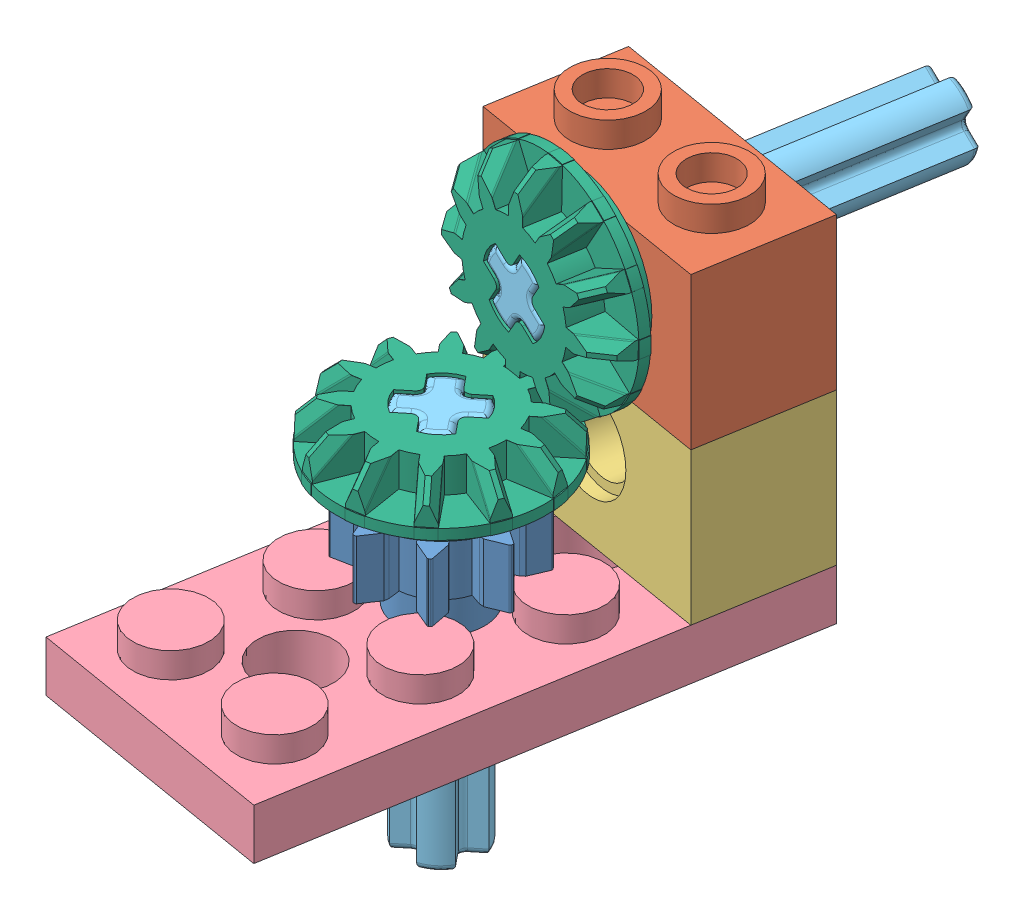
SolidWorks assembly Assem1.sldasm, configuration Default (file format 12000). Lengths in mm.
Overall size (21.06 37.52 45.26).
8 component instances, 6 part files, 20 mates.
Components (placement in the parent):
- 3647 Gear 8-1: 3647 Gear 8.SLDPRT [Default] at (17.502 7.5649 0.6743) x (-0.775809 0 0.630968) z (-0.630968 0 -0.775809) size (10.06 8 10.06)
- 3700 Brick 1 x 2 with Hole-1: 3700 Brick 1 x 2 with Hole.SLDPRT [Default] at (19.4826 13.1649 -11.1611) x (0.986286 0 0.165048) z (-0.165048 0 0.986286) size (16 11.2 8)
- 3700 Brick 1 x 2 with Hole Blue-1: 3700 Brick 1 x 2 with Hole Blue.SLDPRT [Default] at (19.4826 3.5649 -11.1611) x (-0.986286 0 -0.165048) z (0.165048 0 -0.986286) size (16 11.2 8)
- 3709b Plate 2 x 4 with 3 Holes-1: 3709b Plate 2 x 4 with 3 Holes.SLDPRT [Default] at (13.5569 0.3649 0.0141) x (0.165048 0 -0.986286) z (0.986286 0 0.165048) size (32 4.8 16)
- 4519 Axle 3-1: 4519 Axle 3.SLDPRT [Default] at (17.502 -9.6351 0.6743) x (0.775809 0 -0.630968) z (0.630968 0 0.775809) size (4.8 24 4.8)
- 6589 Gear 12 Bevel Gray-1: 6589 Gear 12 Bevel Gray.SLDPRT [기본] at (17.502 10.3649 0.6743) x (-0.630968 0 -0.775809) z (0.775809 0 -0.630968) size (13.27 4.06 13.27)
- 4519 Axle 3-2: 4519 Axle 3.SLDPRT [Default] at (22.1234 18.7649 -26.9417) x (-0.515337 -0.852638 -0.086238) z (-0.840944 0.522502 -0.140726) size (4.8 24 4.8)
- 6589 Gear 12 Bevel Gray-2: 6589 Gear 12 Bevel Gray.SLDPRT [기본] at (18.8224 18.7649 -7.216) x (0.515337 0.852638 0.086238) z (0.840944 -0.522502 0.140726) size (13.27 4.06 13.27)
Mates (geometry in assembly coordinates):
- Concentric1: concentric aligned: cylinder of 4519 Axle 3-1 through (17.502 14.3649 0.6743) axis (0 -1 0) radius 2.4; cylinder of 6589 Gear 12 Bevel Gray-1 through (17.502 14.42 0.6743) axis (0 -1 0) radius 2.4
- Coincident1: coincident anti-aligned: plane of 4519 Axle 3-1 through (19.7895 14.3649 -0.0519) normal (0.630968 0 0.775809); plane of 6589 Gear 12 Bevel Gray-1 through (17.3746 14.42 1.9123) normal (-0.630968 0 -0.775809)
- Coincident2: coincident aligned: plane of 4519 Axle 3-1 through (17.502 14.3649 0.6743) normal (0 1 0); plane of 6589 Gear 12 Bevel Gray-1 through (17.502 14.3649 0.6743) normal (0 1 0)
- Concentric2: concentric anti-aligned: cylinder of 3647 Gear 8-1 through (17.502 3.5649 0.6743) axis (0 1 0) radius 2.4; cylinder of 4519 Axle 3-1 through (17.502 14.3649 0.6743) axis (0 -1 0) radius 2.4
- Coincident3: coincident anti-aligned: plane of 3647 Gear 8-1 through (19.5936 3.5649 1.8513) normal (-0.775809 0 0.630968); plane of 4519 Axle 3-1 through (17.6295 14.3649 -0.5637) normal (0.775809 0 -0.630968)
- Coincident5: coincident anti-aligned: plane of 3647 Gear 8-1 through (17.502 11.5649 0.6743) normal (0 1 0); plane of 6589 Gear 12 Bevel Gray-1 through (27.7161 11.5649 0.9163) normal (0 -1 0)
- Concentric3: concentric aligned: cylinder of 4519 Axle 3-2 through (18.1622 18.7649 -3.2709) axis (0.165048 0 -0.986286) radius 2.4; cylinder of 6589 Gear 12 Bevel Gray-2 through (18.1531 18.7649 -3.2165) axis (0.165048 0 -0.986286) radius 2.4
- Coincident6: coincident anti-aligned: plane of 4519 Axle 3-2 through (16.2715 17.3209 -3.5872) normal (-0.840944 0.522502 -0.140726); plane of 6589 Gear 12 Bevel Gray-2 through (17.8666 19.9751 -3.2645) normal (0.840944 -0.522502 0.140726)
- Coincident7: coincident aligned: plane of 4519 Axle 3-2 through (18.1622 18.7649 -3.2709) normal (-0.165048 0 0.986286); plane of 6589 Gear 12 Bevel Gray-2 through (18.1622 18.7649 -3.2709) normal (-0.165048 0 0.986286)
- Coincident9: coincident aligned: plane of 3700 Brick 1 x 2 with Hole Blue-1 through (20.1428 3.5649 -15.1063) normal (0.165048 0 -0.986286); plane of 3709b Plate 2 x 4 with 3 Holes-1 through (20.1428 3.5649 -15.1063) normal (0.165048 0 -0.986286)
- Coincident10: coincident aligned: plane of 3700 Brick 1 x 2 with Hole Blue-1 through (10.9321 13.1649 -8.5364) normal (-0.986286 0 -0.165048); plane of 3709b Plate 2 x 4 with 3 Holes-1 through (6.971 3.5649 15.1345) normal (-0.986286 0 -0.165048)
- Coincident11: coincident anti-aligned: plane of 3700 Brick 1 x 2 with Hole Blue-1 through (26.7127 3.5649 -5.8956) normal (0 -1 0); plane of 3709b Plate 2 x 4 with 3 Holes-1 through (13.5569 3.5649 0.0141) normal (0 1 0)
- Coincident12: coincident aligned: plane of 3700 Brick 1 x 2 with Hole-1 through (28.0331 22.7649 -13.7859) normal (0.986286 0 0.165048); plane of 3700 Brick 1 x 2 with Hole Blue-1 through (26.7127 13.1649 -5.8956) normal (0.986286 0 0.165048)
- Coincident13: coincident aligned: plane of 3700 Brick 1 x 2 with Hole-1 through (20.1428 13.1649 -15.1063) normal (0.165048 0 -0.986286); plane of 3700 Brick 1 x 2 with Hole Blue-1 through (20.1428 3.5649 -15.1063) normal (0.165048 0 -0.986286)
- Coincident14: coincident anti-aligned: plane of 3700 Brick 1 x 2 with Hole-1 through (12.2525 13.1649 -16.4267) normal (0 -1 0); plane of 3700 Brick 1 x 2 with Hole Blue-1 through (26.7127 13.1649 -5.8956) normal (0 1 0)
- Concentric4: concentric aligned: cylinder of 3709b Plate 2 x 4 with 3 Holes-1 through (17.502 5.1649 0.6743) axis (0 -1 0) radius 2.4; cylinder of 4519 Axle 3-1 through (17.502 14.3649 0.6743) axis (0 -1 0) radius 2.4
- Coincident15: coincident anti-aligned: plane of 3647 Gear 8-1 through (17.502 3.5649 0.6743) normal (0 -1 0); plane of 3709b Plate 2 x 4 with 3 Holes-1 through (13.5569 3.5649 0.0141) normal (0 1 0)
- Concentric5: concentric anti-aligned: cylinder of 3700 Brick 1 x 2 with Hole-1 through (20.1428 18.7649 -15.1063) axis (-0.165048 0 0.986286) radius 2.4; cylinder of 4519 Axle 3-2 through (18.1622 18.7649 -3.2709) axis (0.165048 0 -0.986286) radius 2.4
- Coincident16: coincident anti-aligned: plane of 3700 Brick 1 x 2 with Hole-1 through (18.8224 13.1649 -7.216) normal (-0.165048 0 0.986286); plane of 6589 Gear 12 Bevel Gray-2 through (18.8224 18.7649 -7.216) normal (0.165048 0 -0.986286)
- GearMate1: gear = 8.065 mm: circle of 6589 Gear 12 Bevel Gray-1; circle of 6589 Gear 12 Bevel Gray-2
